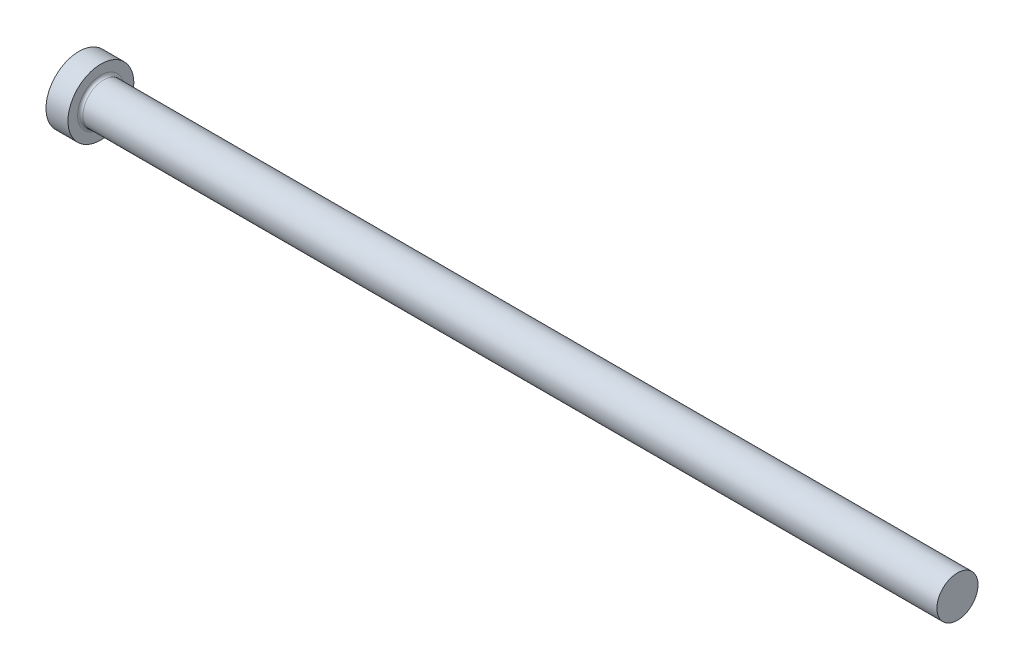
ISO-10303-21;
HEADER;
FILE_DESCRIPTION(('STEP AP214'),'2;1');
FILE_NAME('part.step','',(''),(''),'','','');
FILE_SCHEMA(('AUTOMOTIVE_DESIGN { 1 0 10303 214 1 1 1 1 }'));
ENDSEC;
DATA;
#1=APPLICATION_CONTEXT('core data for automotive mechanical design processes');
#2=APPLICATION_PROTOCOL_DEFINITION('international standard','automotive_design',2000,#1);
#3=PRODUCT_CONTEXT('',#1,'mechanical');
#4=PRODUCT('Part','Part','',(#3));
#5=PRODUCT_RELATED_PRODUCT_CATEGORY('part','',(#4));
#6=PRODUCT_DEFINITION_FORMATION('','',#4);
#7=PRODUCT_DEFINITION_CONTEXT('part definition',#1,'design');
#8=PRODUCT_DEFINITION('design','',#6,#7);
#9=PRODUCT_DEFINITION_SHAPE('','',#8);
#10=(LENGTH_UNIT() NAMED_UNIT(*) SI_UNIT(.MILLI.,.METRE.));
#11=(NAMED_UNIT(*) PLANE_ANGLE_UNIT() SI_UNIT($,.RADIAN.));
#12=(NAMED_UNIT(*) SI_UNIT($,.STERADIAN.) SOLID_ANGLE_UNIT());
#13=UNCERTAINTY_MEASURE_WITH_UNIT(LENGTH_MEASURE(1.E-05),#10,'distance_accuracy_value','');
#14=(GEOMETRIC_REPRESENTATION_CONTEXT(3) GLOBAL_UNCERTAINTY_ASSIGNED_CONTEXT((#13)) GLOBAL_UNIT_ASSIGNED_CONTEXT((#10,
#11,#12)) REPRESENTATION_CONTEXT('',''));
#15=CARTESIAN_POINT('',(0.,0.,0.));
#16=DIRECTION('',(0.,0.,1.));
#17=DIRECTION('',(1.,0.,0.));
#18=AXIS2_PLACEMENT_3D('',#15,#16,#17);
#19=CARTESIAN_POINT('',(0.,0.,0.));
#20=DIRECTION('',(1.,0.,0.));
#21=DIRECTION('',(0.,1.,0.));
#22=AXIS2_PLACEMENT_3D('',#19,#20,#21);
#23=PLANE('',#22);
#24=CARTESIAN_POINT('',(0.,0.,0.));
#25=DIRECTION('',(-1.,0.,0.));
#26=DIRECTION('',(0.,-1.,0.));
#27=AXIS2_PLACEMENT_3D('',#24,#25,#26);
#28=CIRCLE('',#27,9.52499999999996);
#29=CARTESIAN_POINT('',(0.,-9.52499999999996,0.));
#30=VERTEX_POINT('',#29);
#31=EDGE_CURVE('E10',#30,#30,#28,.T.);
#32=ORIENTED_EDGE('',*,*,#31,.T.);
#33=EDGE_LOOP('',(#32));
#34=FACE_BOUND('',#33,.T.);
#35=ADVANCED_FACE('F29',(#34),#23,.F.);
#36=CARTESIAN_POINT('',(254.,0.,0.));
#37=DIRECTION('',(-1.,0.,0.));
#38=DIRECTION('',(0.,-1.,0.));
#39=AXIS2_PLACEMENT_3D('',#36,#37,#38);
#40=CYLINDRICAL_SURFACE('',#39,9.52499999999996);
#41=ORIENTED_EDGE('',*,*,#31,.F.);
#42=EDGE_LOOP('',(#41));
#43=FACE_BOUND('',#42,.T.);
#44=CARTESIAN_POINT('',(6.34999999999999,0.,0.));
#45=DIRECTION('',(-1.,0.,0.));
#46=DIRECTION('',(0.,-1.,0.));
#47=AXIS2_PLACEMENT_3D('',#44,#45,#46);
#48=CIRCLE('',#47,9.52499999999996);
#49=CARTESIAN_POINT('',(6.35,-9.52499999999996,0.));
#50=VERTEX_POINT('',#49);
#51=EDGE_CURVE('E35',#50,#50,#48,.T.);
#52=ORIENTED_EDGE('',*,*,#51,.T.);
#53=EDGE_LOOP('',(#52));
#54=FACE_BOUND('',#53,.T.);
#55=ADVANCED_FACE('F64',(#43,#54),#40,.T.);
#56=CARTESIAN_POINT('',(6.35,9.52499999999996,0.));
#57=DIRECTION('',(-1.,0.,0.));
#58=DIRECTION('',(0.,-1.,0.));
#59=AXIS2_PLACEMENT_3D('',#56,#57,#58);
#60=PLANE('',#59);
#61=ORIENTED_EDGE('',*,*,#51,.F.);
#62=EDGE_LOOP('',(#61));
#63=FACE_BOUND('',#62,.T.);
#64=CARTESIAN_POINT('',(6.34999999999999,0.,0.));
#65=DIRECTION('',(-1.,0.,0.));
#66=DIRECTION('',(0.,-1.,0.));
#67=AXIS2_PLACEMENT_3D('',#64,#65,#66);
#68=CIRCLE('',#67,6.73481);
#69=CARTESIAN_POINT('',(6.34999999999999,-6.73481,0.));
#70=VERTEX_POINT('',#69);
#71=EDGE_CURVE('E39',#70,#70,#68,.T.);
#72=ORIENTED_EDGE('',*,*,#71,.T.);
#73=EDGE_LOOP('',(#72));
#74=FACE_BOUND('',#73,.T.);
#75=ADVANCED_FACE('F68',(#63,#74),#60,.F.);
#76=CARTESIAN_POINT('',(7.1374,0.,0.));
#77=DIRECTION('',(-1.,0.,0.));
#78=DIRECTION('',(0.,-1.,0.));
#79=AXIS2_PLACEMENT_3D('',#76,#77,#78);
#80=TOROIDAL_SURFACE('',#79,6.73481,0.787399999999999);
#81=ORIENTED_EDGE('',*,*,#71,.F.);
#82=EDGE_LOOP('',(#81));
#83=FACE_BOUND('',#82,.T.);
#84=CARTESIAN_POINT('',(7.13739999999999,0.,0.));
#85=DIRECTION('',(-1.,0.,0.));
#86=DIRECTION('',(0.,-1.,0.));
#87=AXIS2_PLACEMENT_3D('',#84,#85,#86);
#88=CIRCLE('',#87,5.94741);
#89=CARTESIAN_POINT('',(7.13739999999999,-5.94741,0.));
#90=VERTEX_POINT('',#89);
#91=EDGE_CURVE('E43',#90,#90,#88,.T.);
#92=ORIENTED_EDGE('',*,*,#91,.T.);
#93=EDGE_LOOP('',(#92));
#94=FACE_BOUND('',#93,.T.);
#95=ADVANCED_FACE('F60',(#83,#94),#80,.F.);
#96=CARTESIAN_POINT('',(254.,0.,0.));
#97=DIRECTION('',(-1.,0.,0.));
#98=DIRECTION('',(0.,-1.,0.));
#99=AXIS2_PLACEMENT_3D('',#96,#97,#98);
#100=CYLINDRICAL_SURFACE('',#99,5.94740999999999);
#101=ORIENTED_EDGE('',*,*,#91,.F.);
#102=EDGE_LOOP('',(#101));
#103=FACE_BOUND('',#102,.T.);
#104=CARTESIAN_POINT('',(254.,0.,0.));
#105=DIRECTION('',(-1.,0.,0.));
#106=DIRECTION('',(0.,-1.,0.));
#107=AXIS2_PLACEMENT_3D('',#104,#105,#106);
#108=CIRCLE('',#107,5.94740999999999);
#109=CARTESIAN_POINT('',(254.,-5.94740999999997,0.));
#110=VERTEX_POINT('',#109);
#111=EDGE_CURVE('E48',#110,#110,#108,.T.);
#112=ORIENTED_EDGE('',*,*,#111,.T.);
#113=EDGE_LOOP('',(#112));
#114=FACE_BOUND('',#113,.T.);
#115=ADVANCED_FACE('F52',(#103,#114),#100,.T.);
#116=CARTESIAN_POINT('',(254.,5.94741,0.));
#117=DIRECTION('',(-1.,0.,0.));
#118=DIRECTION('',(0.,-1.,0.));
#119=AXIS2_PLACEMENT_3D('',#116,#117,#118);
#120=PLANE('',#119);
#121=ORIENTED_EDGE('',*,*,#111,.F.);
#122=EDGE_LOOP('',(#121));
#123=FACE_BOUND('',#122,.T.);
#124=ADVANCED_FACE('F54',(#123),#120,.F.);
#125=CLOSED_SHELL('',(#35,#55,#75,#95,#115,#124));
#126=MANIFOLD_SOLID_BREP('B2',#125);
#127=ADVANCED_BREP_SHAPE_REPRESENTATION('',(#18,#126),#14);
#128=SHAPE_DEFINITION_REPRESENTATION(#9,#127);
ENDSEC;
END-ISO-10303-21;
